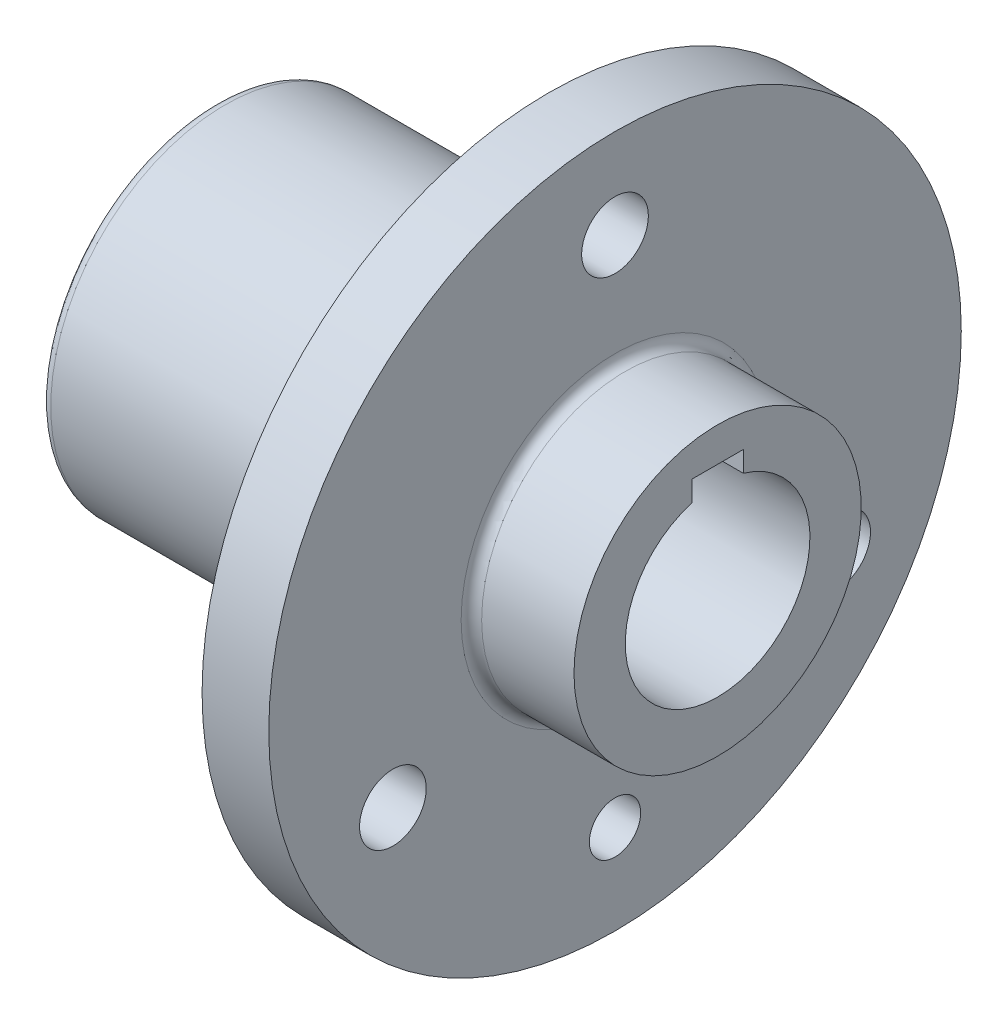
from build123d import *

# Parameters (mm, degrees)
FILLET1_R          = 2
FILLET2_R          = 2
SKETCH2_W          = 10
SKETCH2_H          = 6.6
CUT_EXTRUDE1_DEPTH = 52
SKETCH3_R          = 6.5
SKETCH3_R_2        = 5
CUT_EXTRUDE2_DEPTH = 52


with BuildPart() as part:
    # Sketch1 → Revolve1 (revolve)
    with BuildSketch(Plane.XY, mode=Mode.PRIVATE) as revolve1_sk:
        Polygon((-48.746583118, 0), (-48.746583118, 5), (-43.746583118, 5), (-43.746583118, 24), (21.253416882, 24), (21.253416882, 57.5), (34.253416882, 57.5), (34.253416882, 18), (54.253416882, 18), (54.253416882, 8), (2.253416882, 8), (2.253416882, 14), (-33.746583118, 14), (-33.746583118, 3), (-36.746583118, 0), align=None)
    revolve(revolve1_sk.sketch.rotate(Axis((-48.746583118, -10, 0), (1, 0, 0)), 90), axis=Axis((-48.746583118, -10, 0), (1, 0, 0)))

    # Fillet1
    fillet1_edges = [part.edges().sort_by_distance(p)[0] for p in [
        (-43.746583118, -10, -15),
        (-43.746583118, -10, -34),
        (21.253416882, -10, -34),
        (34.253416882, -10, -28),
    ]]
    fillet(fillet1_edges, radius=FILLET1_R)

    # Fillet2
    fillet2_edges = [part.edges().sort_by_distance(p)[0] for p in [
        (2.253416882, -10, -18),
        (-33.746583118, -10, -24),
    ]]
    fillet(fillet2_edges, radius=FILLET2_R)

    # Sketch2 → Cut-Extrude1 (cut)
    with BuildSketch(Plane(origin=(54.253416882, 0, 0), x_dir=(0, 0, -1), z_dir=(1, 0, 0))):
        with Locations((0, 8)):
            Rectangle(SKETCH2_W, SKETCH2_H)
    extrude(amount=-CUT_EXTRUDE1_DEPTH, mode=Mode.SUBTRACT)

    # Sketch3 → Cut-Extrude2 (cut)
    with BuildSketch(Plane(origin=(34.253416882, 0, 0), x_dir=(0, 0, -1), z_dir=(1, 0, 0))):
        with Locations((0, 40)):
            Circle(SKETCH3_R)
        with Locations((43.301270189, -35)):
            Circle(SKETCH3_R)
        with Locations((-43.301270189, -35)):
            Circle(SKETCH3_R)
        with Locations((0, -60)):
            Circle(SKETCH3_R_2)
    extrude(amount=-CUT_EXTRUDE2_DEPTH, mode=Mode.SUBTRACT)


solid = part.part
